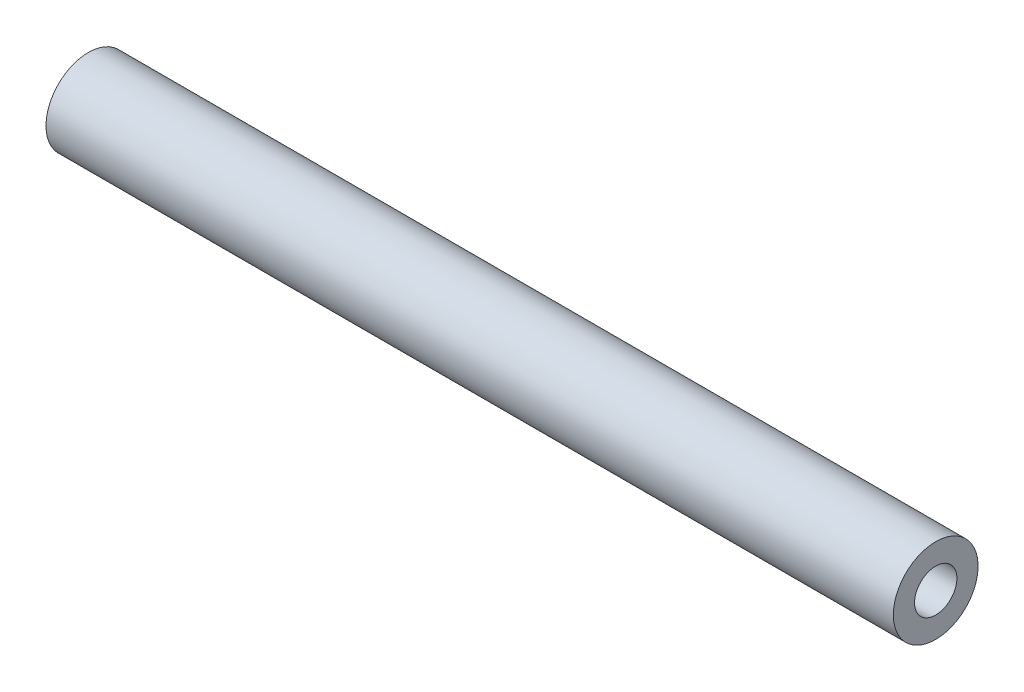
ISO-10303-21;
HEADER;
FILE_DESCRIPTION(('STEP AP214'),'2;1');
FILE_NAME('part.step','',(''),(''),'','','');
FILE_SCHEMA(('AUTOMOTIVE_DESIGN { 1 0 10303 214 1 1 1 1 }'));
ENDSEC;
DATA;
#1=APPLICATION_CONTEXT('core data for automotive mechanical design processes');
#2=APPLICATION_PROTOCOL_DEFINITION('international standard','automotive_design',2000,#1);
#3=PRODUCT_CONTEXT('',#1,'mechanical');
#4=PRODUCT('Part','Part','',(#3));
#5=PRODUCT_RELATED_PRODUCT_CATEGORY('part','',(#4));
#6=PRODUCT_DEFINITION_FORMATION('','',#4);
#7=PRODUCT_DEFINITION_CONTEXT('part definition',#1,'design');
#8=PRODUCT_DEFINITION('design','',#6,#7);
#9=PRODUCT_DEFINITION_SHAPE('','',#8);
#10=(LENGTH_UNIT() NAMED_UNIT(*) SI_UNIT(.MILLI.,.METRE.));
#11=(NAMED_UNIT(*) PLANE_ANGLE_UNIT() SI_UNIT($,.RADIAN.));
#12=(NAMED_UNIT(*) SI_UNIT($,.STERADIAN.) SOLID_ANGLE_UNIT());
#13=UNCERTAINTY_MEASURE_WITH_UNIT(LENGTH_MEASURE(1.E-05),#10,'distance_accuracy_value','');
#14=(GEOMETRIC_REPRESENTATION_CONTEXT(3) GLOBAL_UNCERTAINTY_ASSIGNED_CONTEXT((#13)) GLOBAL_UNIT_ASSIGNED_CONTEXT((#10,
#11,#12)) REPRESENTATION_CONTEXT('',''));
#15=CARTESIAN_POINT('',(0.,0.,0.));
#16=DIRECTION('',(0.,0.,1.));
#17=DIRECTION('',(1.,0.,0.));
#18=AXIS2_PLACEMENT_3D('',#15,#16,#17);
#19=CARTESIAN_POINT('',(0.,0.,0.));
#20=DIRECTION('',(-1.,0.,0.));
#21=DIRECTION('',(0.,0.,1.));
#22=AXIS2_PLACEMENT_3D('',#19,#20,#21);
#23=PLANE('',#22);
#24=CARTESIAN_POINT('',(0.,0.,0.));
#25=DIRECTION('',(1.,0.,0.));
#26=DIRECTION('',(0.,0.,-1.));
#27=AXIS2_PLACEMENT_3D('',#24,#25,#26);
#28=CIRCLE('',#27,2.5);
#29=CARTESIAN_POINT('',(0.,0.,-2.5));
#30=VERTEX_POINT('',#29);
#31=EDGE_CURVE('E51',#30,#30,#28,.T.);
#32=ORIENTED_EDGE('',*,*,#31,.F.);
#33=EDGE_LOOP('',(#32));
#34=FACE_BOUND('',#33,.T.);
#35=CARTESIAN_POINT('',(0.,0.,0.));
#36=DIRECTION('',(-1.,0.,0.));
#37=DIRECTION('',(0.,0.,1.));
#38=AXIS2_PLACEMENT_3D('',#35,#36,#37);
#39=CIRCLE('',#38,5.);
#40=CARTESIAN_POINT('',(0.,0.,5.));
#41=VERTEX_POINT('',#40);
#42=EDGE_CURVE('E11',#41,#41,#39,.T.);
#43=ORIENTED_EDGE('',*,*,#42,.F.);
#44=EDGE_LOOP('',(#43));
#45=FACE_BOUND('',#44,.T.);
#46=ADVANCED_FACE('F33',(#34,#45),#23,.F.);
#47=CARTESIAN_POINT('',(0.,0.,0.));
#48=DIRECTION('',(-1.,0.,0.));
#49=DIRECTION('',(0.,0.,1.));
#50=AXIS2_PLACEMENT_3D('',#47,#48,#49);
#51=CYLINDRICAL_SURFACE('',#50,4.99999999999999);
#52=CARTESIAN_POINT('',(-100.,0.,0.));
#53=DIRECTION('',(-1.,0.,0.));
#54=DIRECTION('',(0.,0.,1.));
#55=AXIS2_PLACEMENT_3D('',#52,#53,#54);
#56=CIRCLE('',#55,4.99999999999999);
#57=CARTESIAN_POINT('',(-100.,0.,4.99999999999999));
#58=VERTEX_POINT('',#57);
#59=EDGE_CURVE('E39',#58,#58,#56,.T.);
#60=ORIENTED_EDGE('',*,*,#59,.F.);
#61=EDGE_LOOP('',(#60));
#62=FACE_BOUND('',#61,.T.);
#63=ORIENTED_EDGE('',*,*,#42,.T.);
#64=EDGE_LOOP('',(#63));
#65=FACE_BOUND('',#64,.T.);
#66=ADVANCED_FACE('F60',(#62,#65),#51,.T.);
#67=CARTESIAN_POINT('',(-100.,0.,0.));
#68=DIRECTION('',(1.,0.,0.));
#69=DIRECTION('',(0.,0.,-1.));
#70=AXIS2_PLACEMENT_3D('',#67,#68,#69);
#71=PLANE('',#70);
#72=ORIENTED_EDGE('',*,*,#59,.T.);
#73=EDGE_LOOP('',(#72));
#74=FACE_BOUND('',#73,.T.);
#75=ADVANCED_FACE('F58',(#74),#71,.F.);
#76=CARTESIAN_POINT('',(0.,0.,0.));
#77=DIRECTION('',(1.,0.,0.));
#78=DIRECTION('',(0.,0.,-1.));
#79=AXIS2_PLACEMENT_3D('',#76,#77,#78);
#80=CYLINDRICAL_SURFACE('',#79,2.5);
#81=CARTESIAN_POINT('',(-17.,0.,0.));
#82=DIRECTION('',(1.,0.,0.));
#83=DIRECTION('',(0.,0.,-1.));
#84=AXIS2_PLACEMENT_3D('',#81,#82,#83);
#85=CIRCLE('',#84,2.5);
#86=CARTESIAN_POINT('',(-17.,0.,-2.5));
#87=VERTEX_POINT('',#86);
#88=EDGE_CURVE('E49',#87,#87,#85,.T.);
#89=ORIENTED_EDGE('',*,*,#88,.F.);
#90=EDGE_LOOP('',(#89));
#91=FACE_BOUND('',#90,.T.);
#92=ORIENTED_EDGE('',*,*,#31,.T.);
#93=EDGE_LOOP('',(#92));
#94=FACE_BOUND('',#93,.T.);
#95=ADVANCED_FACE('F45',(#91,#94),#80,.F.);
#96=CARTESIAN_POINT('',(-17.,0.,0.));
#97=DIRECTION('',(1.,0.,0.));
#98=DIRECTION('',(0.,0.,-1.));
#99=AXIS2_PLACEMENT_3D('',#96,#97,#98);
#100=CONICAL_SURFACE('',#99,2.5,1.02974425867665);
#101=CARTESIAN_POINT('',(-18.5021515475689,0.,0.));
#102=VERTEX_POINT('',#101);
#103=VERTEX_LOOP('',#102);
#104=FACE_BOUND('',#103,.T.);
#105=ORIENTED_EDGE('',*,*,#88,.T.);
#106=EDGE_LOOP('',(#105));
#107=FACE_BOUND('',#106,.T.);
#108=ADVANCED_FACE('F42',(#104,#107),#100,.F.);
#109=CLOSED_SHELL('',(#46,#66,#75,#95,#108));
#110=MANIFOLD_SOLID_BREP('B2',#109);
#111=ADVANCED_BREP_SHAPE_REPRESENTATION('',(#18,#110),#14);
#112=SHAPE_DEFINITION_REPRESENTATION(#9,#111);
ENDSEC;
END-ISO-10303-21;
